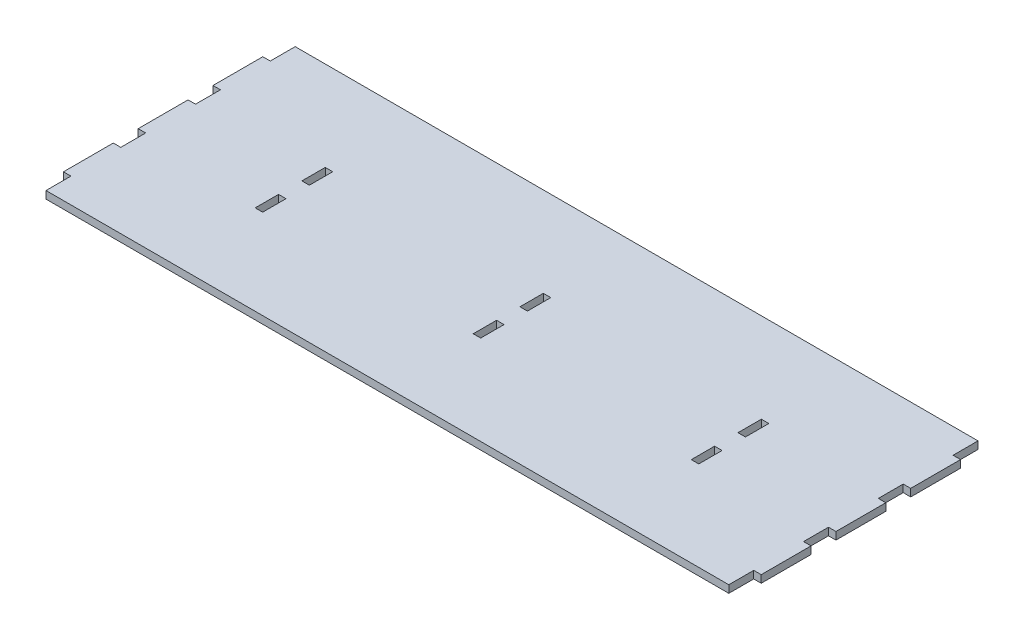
from build123d import *

# Parameters (mm, degrees)
SALIENTE_EXTRUIR1_DEPTH = 12
CROQUIS2_W              = 13
CROQUIS2_H              = 13
CROQUIS4_W              = 12
CROQUIS4_H              = 37.5
CORTAR_EXTRUIR1_DEPTH   = 12


with BuildPart() as part:
    # Croquis1 → Saliente-Extruir1 (new body)
    with BuildSketch(Plane(origin=(0, 0, 0), x_dir=(1, 0, 0), z_dir=(0, 1, 0))):
        Polygon((-560, -40), (-560, 40), (-548, 40), (-548, 80), (-560, 80), (-560, 160), (-548, 160), (-548, 200), (548, 200), (548, 160), (560, 160), (560, 80), (548, 80), (548, 40), (560, 40), (560, -40), (548, -40), (548, -80), (560, -80), (560, -160), (548, -160), (548, -200), (-548, -200), (-548, -160), (-560, -160), (-560, -80), (-548, -80), (-548, -40), align=None)
    extrude(amount=SALIENTE_EXTRUIR1_DEPTH)

    # Cortar-Barrer1: sweep along a path in Croquis3
    with BuildLine(Plane(origin=(0, 0, 0), x_dir=(1, 0, 0), z_dir=(0, 1, 0))) as cortar_barrer1_path:
        Line((368, 154), (-368, 154))
        ThreePointArc((-368, 154), (-466.994949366, 112.994949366), (-508, 14))
        Line((-508, 14), (-508, 0))
        Line((-508, 0), (-508, -14))
        ThreePointArc((-508, -14), (-466.994949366, -112.994949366), (-368, -154))
        Line((-368, -154), (368, -154))
        ThreePointArc((368, -154), (466.994949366, -112.994949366), (508, -14))
        Line((508, -14), (508, 0))
        Line((508, 0), (508, 14))
        ThreePointArc((508, 14), (466.994949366, 112.994949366), (368, 154))
    # Croquis2 → Cortar-Barrer1 (sweep, cut)
    with BuildSketch(Plane(origin=(0, 0, 0), x_dir=(0, 0, -1), z_dir=(1, 0, 0))):
        with Locations((154, 0)):
            Rectangle(CROQUIS2_W, CROQUIS2_H)
    sweep(path=cortar_barrer1_path.line, mode=Mode.SUBTRACT)

    # Croquis4 → Cortar-Extruir1 (cut)
    with BuildSketch(Plane(origin=(0, 0, 0), x_dir=(-1, 0, 0), z_dir=(0, -1, 0))):
        with Locations((0, 37.5)):
            Rectangle(CROQUIS4_W, CROQUIS4_H)
        with Locations((0, -37.5)):
            Rectangle(CROQUIS4_W, CROQUIS4_H)
        with Locations((350, 37.5)):
            Rectangle(CROQUIS4_W, CROQUIS4_H)
        with Locations((350, -37.5)):
            Rectangle(CROQUIS4_W, CROQUIS4_H)
        with Locations((-350, 37.5)):
            Rectangle(CROQUIS4_W, CROQUIS4_H)
        with Locations((-350, -37.5)):
            Rectangle(CROQUIS4_W, CROQUIS4_H)
    extrude(amount=-CORTAR_EXTRUIR1_DEPTH, mode=Mode.SUBTRACT)


solid = part.part
